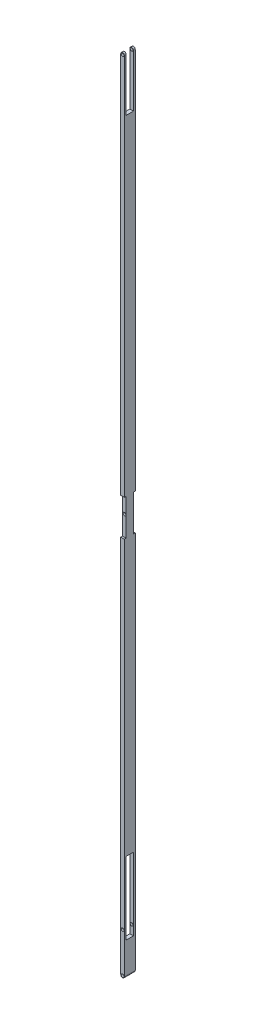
from build123d import *

# Parameters (mm, degrees)
AUFSATZ_LINEAR_AUSTRAGEN1_DEPTH      = 30
SCHNITT_LINEAR_AUSTRAGEN3_DEPTH      = 2206.226745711
SCHNITT_LINEAR_AUSTRAGEN3_DEPTH_BACK = 2206.226745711
SKIZZE6_W                            = 20
SKIZZE6_H                            = 200
SCHNITT_LINEAR_AUSTRAGEN4_DEPTH      = 2206.147387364
SCHNITT_LINEAR_AUSTRAGEN4_DEPTH_BACK = 2206.147387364
SKIZZE7_R                            = 4
SCHNITT_LINEAR_AUSTRAGEN5_DEPTH      = 2206.209740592
SCHNITT_LINEAR_AUSTRAGEN5_DEPTH_BACK = 2206.209740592
SKIZZE8_R                            = 4
SKIZZE9_W                            = 5
SKIZZE9_H                            = 100
SCHNITT_LINEAR_AUSTRAGEN6_DEPTH      = 2206.226745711
SKIZZE10_R                           = 4
SCHNITT_LINEAR_AUSTRAGEN7_DEPTH      = 2206.209740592
SKIZZE11_R                           = 4
SCHNITT_LINEAR_AUSTRAGEN8_DEPTH      = 2206.209740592
SKIZZE12_W                           = 20
SKIZZE12_H                           = 150
SCHNITT_LINEAR_AUSTRAGEN9_DEPTH      = 2206.226745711


with BuildPart() as part:
    # Skizze2 → Aufsatz-Linear austragen1 (new body)
    with BuildSketch(Plane.XY):
        with BuildLine():
            Line((-5, 0), (-5, 2200))
            ThreePointArc((-5, 2200), (0, 2205), (5, 2200))
            Line((5, 2200), (5, 0))
            ThreePointArc((5, 0), (0, -5), (-5, 0))
        make_face()
    extrude(amount=AUFSATZ_LINEAR_AUSTRAGEN1_DEPTH)

    # Skizze6 → Schnitt-Linear austragen3 (cut, two sides: drawn at the far end of the back side and taken through both)
    with BuildSketch(Plane(origin=(5, 0, 0), x_dir=(0, 0, -1), z_dir=(1, 0, 0)).offset(-SCHNITT_LINEAR_AUSTRAGEN3_DEPTH_BACK)):
        with Locations((-15, 185)):
            Rectangle(SKIZZE6_W, SKIZZE6_H)
    extrude(amount=SCHNITT_LINEAR_AUSTRAGEN3_DEPTH + SCHNITT_LINEAR_AUSTRAGEN3_DEPTH_BACK, mode=Mode.SUBTRACT)

    # Skizze7 → Schnitt-Linear austragen4 (cut, two sides: drawn at the far end of the back side and taken through both)
    with BuildSketch(Plane(origin=(0, 0, 25), x_dir=(-1, 0, 0), z_dir=(0, 0, -1)).offset(-SCHNITT_LINEAR_AUSTRAGEN4_DEPTH_BACK)):
        with Locations((0, 110)):
            Circle(SKIZZE7_R)
    extrude(amount=SCHNITT_LINEAR_AUSTRAGEN4_DEPTH + SCHNITT_LINEAR_AUSTRAGEN4_DEPTH_BACK, mode=Mode.SUBTRACT)

    # Skizze8 → Schnitt-Linear austragen5 (cut, two sides: drawn at the far end of the back side and taken through both)
    with BuildSketch(Plane.XY.offset(30).offset(-SCHNITT_LINEAR_AUSTRAGEN5_DEPTH_BACK)):
        with Locations((0, 1100)):
            Circle(SKIZZE8_R)
    extrude(amount=SCHNITT_LINEAR_AUSTRAGEN5_DEPTH + SCHNITT_LINEAR_AUSTRAGEN5_DEPTH_BACK, mode=Mode.SUBTRACT)

    # Skizze9 → Schnitt-Linear austragen6 (cut, through all)
    with BuildSketch(Plane(origin=(5, 0, 0), x_dir=(0, 0, -1), z_dir=(1, 0, 0))):
        with Locations((-27.5, 1095)):
            Rectangle(SKIZZE9_W, SKIZZE9_H)
        with Locations((-2.5, 1095)):
            Rectangle(SKIZZE9_W, SKIZZE9_H)
    extrude(amount=-SCHNITT_LINEAR_AUSTRAGEN6_DEPTH, mode=Mode.SUBTRACT)

    # Skizze10 → Schnitt-Linear austragen7 (cut, through all)
    with BuildSketch(Plane.XY.offset(30)):
        with Locations((0, 2200)):
            Circle(SKIZZE10_R)
    extrude(amount=-SCHNITT_LINEAR_AUSTRAGEN7_DEPTH, mode=Mode.SUBTRACT)

    # Skizze11 → Schnitt-Linear austragen8 (cut, through all)
    with BuildSketch(Plane.XY.offset(30)):
        Circle(SKIZZE11_R)
    extrude(amount=-SCHNITT_LINEAR_AUSTRAGEN8_DEPTH, mode=Mode.SUBTRACT)

    # Skizze12 → Schnitt-Linear austragen9 (cut, through all)
    with BuildSketch(Plane(origin=(5, 0, 0), x_dir=(0, 0, -1), z_dir=(1, 0, 0))):
        with Locations((-15, 2130)):
            Rectangle(SKIZZE12_W, SKIZZE12_H)
    extrude(amount=-SCHNITT_LINEAR_AUSTRAGEN9_DEPTH, mode=Mode.SUBTRACT)


solid = part.part
